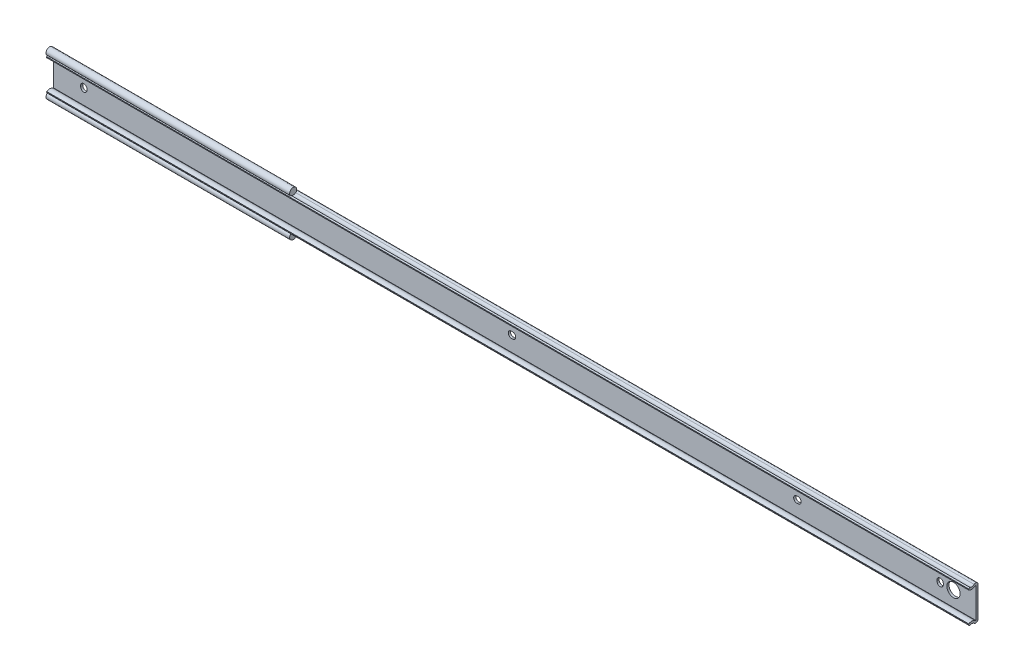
ISO-10303-21;
HEADER;
FILE_DESCRIPTION(('STEP AP214'),'2;1');
FILE_NAME('part.step','',(''),(''),'','','');
FILE_SCHEMA(('AUTOMOTIVE_DESIGN { 1 0 10303 214 1 1 1 1 }'));
ENDSEC;
DATA;
#1=APPLICATION_CONTEXT('core data for automotive mechanical design processes');
#2=APPLICATION_PROTOCOL_DEFINITION('international standard','automotive_design',2000,#1);
#3=PRODUCT_CONTEXT('',#1,'mechanical');
#4=PRODUCT('Part','Part','',(#3));
#5=PRODUCT_RELATED_PRODUCT_CATEGORY('part','',(#4));
#6=PRODUCT_DEFINITION_FORMATION('','',#4);
#7=PRODUCT_DEFINITION_CONTEXT('part definition',#1,'design');
#8=PRODUCT_DEFINITION('design','',#6,#7);
#9=PRODUCT_DEFINITION_SHAPE('','',#8);
#10=(LENGTH_UNIT() NAMED_UNIT(*) SI_UNIT(.MILLI.,.METRE.));
#11=(NAMED_UNIT(*) PLANE_ANGLE_UNIT() SI_UNIT($,.RADIAN.));
#12=(NAMED_UNIT(*) SI_UNIT($,.STERADIAN.) SOLID_ANGLE_UNIT());
#13=UNCERTAINTY_MEASURE_WITH_UNIT(LENGTH_MEASURE(1.E-05),#10,'distance_accuracy_value','');
#14=(GEOMETRIC_REPRESENTATION_CONTEXT(3) GLOBAL_UNCERTAINTY_ASSIGNED_CONTEXT((#13)) GLOBAL_UNIT_ASSIGNED_CONTEXT((#10,
#11,#12)) REPRESENTATION_CONTEXT('',''));
#15=CARTESIAN_POINT('',(0.,0.,0.));
#16=DIRECTION('',(0.,0.,1.));
#17=DIRECTION('',(1.,0.,0.));
#18=AXIS2_PLACEMENT_3D('',#15,#16,#17);
#19=CARTESIAN_POINT('',(-21.4,13.9150000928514,4.44999970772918));
#20=DIRECTION('',(1.,0.,0.));
#21=DIRECTION('',(0.,0.,-1.));
#22=AXIS2_PLACEMENT_3D('',#19,#20,#21);
#23=CYLINDRICAL_SURFACE('',#22,2.55000008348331);
#24=DIRECTION('',(1.,0.,0.));
#25=VECTOR('',#24,1.);
#26=CARTESIAN_POINT('',(-21.4,12.0053612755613,2.76009438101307));
#27=LINE('',#26,#25);
#28=CARTESIAN_POINT('',(152.,12.0053612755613,2.76009438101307));
#29=VERTEX_POINT('',#28);
#30=CARTESIAN_POINT('',(635.,12.0053612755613,2.76009438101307));
#31=VERTEX_POINT('',#30);
#32=EDGE_CURVE('E406',#29,#31,#27,.T.);
#33=ORIENTED_EDGE('',*,*,#32,.F.);
#34=CARTESIAN_POINT('',(152.,13.9150000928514,4.44999970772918));
#35=DIRECTION('',(-1.,0.,0.));
#36=DIRECTION('',(0.,0.,1.));
#37=AXIS2_PLACEMENT_3D('',#34,#35,#36);
#38=CIRCLE('',#37,2.55000008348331);
#39=CARTESIAN_POINT('',(152.,11.8784794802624,5.98462807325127));
#40=VERTEX_POINT('',#39);
#41=EDGE_CURVE('E468',#29,#40,#38,.T.);
#42=ORIENTED_EDGE('',*,*,#41,.T.);
#43=DIRECTION('',(1.,0.,0.));
#44=VECTOR('',#43,1.);
#45=CARTESIAN_POINT('',(-21.4,11.8784794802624,5.98462807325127));
#46=LINE('',#45,#44);
#47=CARTESIAN_POINT('',(635.,11.8784794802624,5.98462807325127));
#48=VERTEX_POINT('',#47);
#49=EDGE_CURVE('E432',#40,#48,#46,.T.);
#50=ORIENTED_EDGE('',*,*,#49,.T.);
#51=CARTESIAN_POINT('',(635.,13.9150000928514,4.44999970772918));
#52=DIRECTION('',(-1.,0.,0.));
#53=DIRECTION('',(0.,0.,-1.));
#54=AXIS2_PLACEMENT_3D('',#51,#52,#53);
#55=CIRCLE('',#54,2.55000008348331);
#56=EDGE_CURVE('E336',#31,#48,#55,.T.);
#57=ORIENTED_EDGE('',*,*,#56,.F.);
#58=EDGE_LOOP('',(#33,#42,#50,#57));
#59=FACE_BOUND('',#58,.T.);
#60=ADVANCED_FACE('F14',(#59),#23,.F.);
#61=CARTESIAN_POINT('',(-21.4,10.762224,1.65999962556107));
#62=DIRECTION('',(1.,0.,0.));
#63=DIRECTION('',(0.,0.,-1.));
#64=AXIS2_PLACEMENT_3D('',#61,#62,#63);
#65=CYLINDRICAL_SURFACE('',#64,1.65999962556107);
#66=DIRECTION('',(-1.,0.,0.));
#67=VECTOR('',#66,1.);
#68=CARTESIAN_POINT('',(65.3,12.2965303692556,2.29364205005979));
#69=LINE('',#68,#67);
#70=CARTESIAN_POINT('',(152.,12.2965303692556,2.29364205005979));
#71=VERTEX_POINT('',#70);
#72=CARTESIAN_POINT('',(-21.4,12.2965303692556,2.29364205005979));
#73=VERTEX_POINT('',#72);
#74=EDGE_CURVE('E275',#71,#73,#69,.T.);
#75=ORIENTED_EDGE('',*,*,#74,.F.);
#76=CARTESIAN_POINT('',(152.,10.762224,1.65999962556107));
#77=DIRECTION('',(-1.,0.,0.));
#78=DIRECTION('',(0.,0.,1.));
#79=AXIS2_PLACEMENT_3D('',#76,#77,#78);
#80=CIRCLE('',#79,1.65999962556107);
#81=EDGE_CURVE('E489',#71,#29,#80,.F.);
#82=ORIENTED_EDGE('',*,*,#81,.T.);
#83=ORIENTED_EDGE('',*,*,#32,.T.);
#84=CARTESIAN_POINT('',(635.,10.762224,1.65999962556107));
#85=DIRECTION('',(1.,0.,0.));
#86=DIRECTION('',(0.,0.,-1.));
#87=AXIS2_PLACEMENT_3D('',#84,#85,#86);
#88=CIRCLE('',#87,1.65999962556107);
#89=CARTESIAN_POINT('',(635.,10.762224,0.));
#90=VERTEX_POINT('',#89);
#91=EDGE_CURVE('E333',#90,#31,#88,.T.);
#92=ORIENTED_EDGE('',*,*,#91,.F.);
#93=DIRECTION('',(1.,0.,0.));
#94=VECTOR('',#93,1.);
#95=CARTESIAN_POINT('',(-21.4,10.762224,0.));
#96=LINE('',#95,#94);
#97=CARTESIAN_POINT('',(-21.4,10.762224,0.));
#98=VERTEX_POINT('',#97);
#99=EDGE_CURVE('E407',#98,#90,#96,.T.);
#100=ORIENTED_EDGE('',*,*,#99,.F.);
#101=CARTESIAN_POINT('',(-21.4,10.762224,1.65999962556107));
#102=DIRECTION('',(1.,0.,0.));
#103=DIRECTION('',(0.,0.,-1.));
#104=AXIS2_PLACEMENT_3D('',#101,#102,#103);
#105=CIRCLE('',#104,1.65999962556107);
#106=EDGE_CURVE('E376',#98,#73,#105,.T.);
#107=ORIENTED_EDGE('',*,*,#106,.T.);
#108=EDGE_LOOP('',(#75,#82,#83,#92,#100,#107));
#109=FACE_BOUND('',#108,.T.);
#110=ADVANCED_FACE('F16',(#109),#65,.T.);
#111=CARTESIAN_POINT('',(-21.4,-10.762224,0.));
#112=DIRECTION('',(0.,0.,-1.));
#113=DIRECTION('',(-1.,0.,0.));
#114=AXIS2_PLACEMENT_3D('',#111,#112,#113);
#115=PLANE('',#114);
#116=CARTESIAN_POINT('',(619.1,0.,0.));
#117=DIRECTION('',(0.,0.,-1.));
#118=DIRECTION('',(-1.,0.,0.));
#119=AXIS2_PLACEMENT_3D('',#116,#117,#118);
#120=CIRCLE('',#119,4.75);
#121=CARTESIAN_POINT('',(614.35,0.,0.));
#122=VERTEX_POINT('',#121);
#123=EDGE_CURVE('E308',#122,#122,#120,.T.);
#124=ORIENTED_EDGE('',*,*,#123,.F.);
#125=EDGE_LOOP('',(#124));
#126=FACE_BOUND('',#125,.T.);
#127=CARTESIAN_POINT('',(508.4,0.,0.));
#128=DIRECTION('',(0.,0.,-1.));
#129=DIRECTION('',(-1.,0.,0.));
#130=AXIS2_PLACEMENT_3D('',#127,#128,#129);
#131=CIRCLE('',#130,2.25);
#132=CARTESIAN_POINT('',(508.4,2.25,0.));
#133=VERTEX_POINT('',#132);
#134=CARTESIAN_POINT('',(508.4,-2.25,0.));
#135=VERTEX_POINT('',#134);
#136=EDGE_CURVE('E272',#133,#135,#131,.T.);
#137=ORIENTED_EDGE('',*,*,#136,.F.);
#138=DIRECTION('',(1.,0.,0.));
#139=VECTOR('',#138,1.);
#140=CARTESIAN_POINT('',(508.4,2.25,0.));
#141=LINE('',#140,#139);
#142=CARTESIAN_POINT('',(507.6,2.25,0.));
#143=VERTEX_POINT('',#142);
#144=EDGE_CURVE('E281',#143,#133,#141,.T.);
#145=ORIENTED_EDGE('',*,*,#144,.F.);
#146=CARTESIAN_POINT('',(507.6,0.,0.));
#147=DIRECTION('',(0.,0.,-1.));
#148=DIRECTION('',(-1.,0.,0.));
#149=AXIS2_PLACEMENT_3D('',#146,#147,#148);
#150=CIRCLE('',#149,2.25);
#151=CARTESIAN_POINT('',(507.6,-2.25,0.));
#152=VERTEX_POINT('',#151);
#153=EDGE_CURVE('E278',#152,#143,#150,.T.);
#154=ORIENTED_EDGE('',*,*,#153,.F.);
#155=DIRECTION('',(-1.,0.,0.));
#156=VECTOR('',#155,1.);
#157=CARTESIAN_POINT('',(508.4,-2.25,0.));
#158=LINE('',#157,#156);
#159=EDGE_CURVE('E274',#135,#152,#158,.T.);
#160=ORIENTED_EDGE('',*,*,#159,.F.);
#161=EDGE_LOOP('',(#137,#145,#154,#160));
#162=FACE_BOUND('',#161,.T.);
#163=CARTESIAN_POINT('',(0.,0.4,0.));
#164=DIRECTION('',(0.,0.,-1.));
#165=DIRECTION('',(-1.,0.,0.));
#166=AXIS2_PLACEMENT_3D('',#163,#164,#165);
#167=CIRCLE('',#166,2.24999999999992);
#168=CARTESIAN_POINT('',(-2.24999999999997,0.4,0.));
#169=VERTEX_POINT('',#168);
#170=CARTESIAN_POINT('',(2.24999999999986,0.4,0.));
#171=VERTEX_POINT('',#170);
#172=EDGE_CURVE('E257',#169,#171,#167,.T.);
#173=ORIENTED_EDGE('',*,*,#172,.F.);
#174=DIRECTION('',(0.,1.,0.));
#175=VECTOR('',#174,1.);
#176=CARTESIAN_POINT('',(-2.24999999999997,0.4,0.));
#177=LINE('',#176,#175);
#178=CARTESIAN_POINT('',(-2.24999999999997,-0.4,0.));
#179=VERTEX_POINT('',#178);
#180=EDGE_CURVE('E262',#179,#169,#177,.T.);
#181=ORIENTED_EDGE('',*,*,#180,.F.);
#182=CARTESIAN_POINT('',(0.,-0.4,0.));
#183=DIRECTION('',(0.,0.,-1.));
#184=DIRECTION('',(-1.,0.,0.));
#185=AXIS2_PLACEMENT_3D('',#182,#183,#184);
#186=CIRCLE('',#185,2.24999999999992);
#187=CARTESIAN_POINT('',(2.24999999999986,-0.4,0.));
#188=VERTEX_POINT('',#187);
#189=EDGE_CURVE('E241',#188,#179,#186,.T.);
#190=ORIENTED_EDGE('',*,*,#189,.F.);
#191=DIRECTION('',(0.,-1.,0.));
#192=VECTOR('',#191,1.);
#193=CARTESIAN_POINT('',(2.24999999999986,0.4,0.));
#194=LINE('',#193,#192);
#195=EDGE_CURVE('E252',#171,#188,#194,.T.);
#196=ORIENTED_EDGE('',*,*,#195,.F.);
#197=EDGE_LOOP('',(#173,#181,#190,#196));
#198=FACE_BOUND('',#197,.T.);
#199=CARTESIAN_POINT('',(305.2,0.,0.));
#200=DIRECTION('',(0.,0.,-1.));
#201=DIRECTION('',(-1.,0.,0.));
#202=AXIS2_PLACEMENT_3D('',#199,#200,#201);
#203=CIRCLE('',#202,2.25);
#204=CARTESIAN_POINT('',(305.2,2.25,0.));
#205=VERTEX_POINT('',#204);
#206=CARTESIAN_POINT('',(305.2,-2.25,0.));
#207=VERTEX_POINT('',#206);
#208=EDGE_CURVE('E269',#205,#207,#203,.T.);
#209=ORIENTED_EDGE('',*,*,#208,.F.);
#210=DIRECTION('',(1.,0.,0.));
#211=VECTOR('',#210,1.);
#212=CARTESIAN_POINT('',(305.2,2.25,0.));
#213=LINE('',#212,#211);
#214=CARTESIAN_POINT('',(304.4,2.25,0.));
#215=VERTEX_POINT('',#214);
#216=EDGE_CURVE('E322',#215,#205,#213,.T.);
#217=ORIENTED_EDGE('',*,*,#216,.F.);
#218=CARTESIAN_POINT('',(304.4,0.,0.));
#219=DIRECTION('',(0.,0.,-1.));
#220=DIRECTION('',(-1.,0.,0.));
#221=AXIS2_PLACEMENT_3D('',#218,#219,#220);
#222=CIRCLE('',#221,2.25);
#223=CARTESIAN_POINT('',(304.4,-2.25,0.));
#224=VERTEX_POINT('',#223);
#225=EDGE_CURVE('E319',#224,#215,#222,.T.);
#226=ORIENTED_EDGE('',*,*,#225,.F.);
#227=DIRECTION('',(-1.,0.,0.));
#228=VECTOR('',#227,1.);
#229=CARTESIAN_POINT('',(305.2,-2.25,0.));
#230=LINE('',#229,#228);
#231=EDGE_CURVE('E316',#207,#224,#230,.T.);
#232=ORIENTED_EDGE('',*,*,#231,.F.);
#233=EDGE_LOOP('',(#209,#217,#226,#232));
#234=FACE_BOUND('',#233,.T.);
#235=CARTESIAN_POINT('',(609.6,0.4,0.));
#236=DIRECTION('',(0.,0.,-1.));
#237=DIRECTION('',(-1.,0.,0.));
#238=AXIS2_PLACEMENT_3D('',#235,#236,#237);
#239=CIRCLE('',#238,2.25);
#240=CARTESIAN_POINT('',(607.35,0.4,0.));
#241=VERTEX_POINT('',#240);
#242=CARTESIAN_POINT('',(611.85,0.4,0.));
#243=VERTEX_POINT('',#242);
#244=EDGE_CURVE('E293',#241,#243,#239,.T.);
#245=ORIENTED_EDGE('',*,*,#244,.F.);
#246=DIRECTION('',(0.,1.,0.));
#247=VECTOR('',#246,1.);
#248=CARTESIAN_POINT('',(607.35,0.4,0.));
#249=LINE('',#248,#247);
#250=CARTESIAN_POINT('',(607.35,-0.4,0.));
#251=VERTEX_POINT('',#250);
#252=EDGE_CURVE('E302',#251,#241,#249,.T.);
#253=ORIENTED_EDGE('',*,*,#252,.F.);
#254=CARTESIAN_POINT('',(609.6,-0.4,0.));
#255=DIRECTION('',(0.,0.,-1.));
#256=DIRECTION('',(-1.,0.,0.));
#257=AXIS2_PLACEMENT_3D('',#254,#255,#256);
#258=CIRCLE('',#257,2.25);
#259=CARTESIAN_POINT('',(611.85,-0.4,0.));
#260=VERTEX_POINT('',#259);
#261=EDGE_CURVE('E299',#260,#251,#258,.T.);
#262=ORIENTED_EDGE('',*,*,#261,.F.);
#263=DIRECTION('',(0.,-1.,0.));
#264=VECTOR('',#263,1.);
#265=CARTESIAN_POINT('',(611.85,0.4,0.));
#266=LINE('',#265,#264);
#267=EDGE_CURVE('E295',#243,#260,#266,.T.);
#268=ORIENTED_EDGE('',*,*,#267,.F.);
#269=EDGE_LOOP('',(#245,#253,#262,#268));
#270=FACE_BOUND('',#269,.T.);
#271=DIRECTION('',(0.,1.,0.));
#272=VECTOR('',#271,1.);
#273=CARTESIAN_POINT('',(-21.4,-10.762224,0.));
#274=LINE('',#273,#272);
#275=CARTESIAN_POINT('',(-21.4,-10.762224,0.));
#276=VERTEX_POINT('',#275);
#277=EDGE_CURVE('E404',#276,#98,#274,.T.);
#278=ORIENTED_EDGE('',*,*,#277,.T.);
#279=ORIENTED_EDGE('',*,*,#99,.T.);
#280=DIRECTION('',(0.,1.,0.));
#281=VECTOR('',#280,1.);
#282=CARTESIAN_POINT('',(635.,-10.762224,0.));
#283=LINE('',#282,#281);
#284=CARTESIAN_POINT('',(635.,-10.762224,0.));
#285=VERTEX_POINT('',#284);
#286=EDGE_CURVE('E373',#285,#90,#283,.T.);
#287=ORIENTED_EDGE('',*,*,#286,.F.);
#288=DIRECTION('',(1.,0.,0.));
#289=VECTOR('',#288,1.);
#290=CARTESIAN_POINT('',(-21.4,-10.762224,0.));
#291=LINE('',#290,#289);
#292=EDGE_CURVE('E410',#276,#285,#291,.T.);
#293=ORIENTED_EDGE('',*,*,#292,.F.);
#294=EDGE_LOOP('',(#278,#279,#287,#293));
#295=FACE_BOUND('',#294,.T.);
#296=ADVANCED_FACE('F259',(#126,#162,#198,#234,#270,#295),#115,.T.);
#297=CARTESIAN_POINT('',(-21.4,-10.762224,1.65999962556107));
#298=DIRECTION('',(1.,0.,0.));
#299=DIRECTION('',(0.,0.,-1.));
#300=AXIS2_PLACEMENT_3D('',#297,#298,#299);
#301=CYLINDRICAL_SURFACE('',#300,1.65999962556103);
#302=DIRECTION('',(-1.,0.,0.));
#303=VECTOR('',#302,1.);
#304=CARTESIAN_POINT('',(65.3,-12.2965303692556,2.29364205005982));
#305=LINE('',#304,#303);
#306=CARTESIAN_POINT('',(-21.4,-12.2965303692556,2.29364205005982));
#307=VERTEX_POINT('',#306);
#308=CARTESIAN_POINT('',(152.,-12.2965303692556,2.29364205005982));
#309=VERTEX_POINT('',#308);
#310=EDGE_CURVE('E579',#307,#309,#305,.F.);
#311=ORIENTED_EDGE('',*,*,#310,.F.);
#312=CARTESIAN_POINT('',(-21.4,-10.762224,1.65999962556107));
#313=DIRECTION('',(1.,0.,0.));
#314=DIRECTION('',(0.,0.,1.));
#315=AXIS2_PLACEMENT_3D('',#312,#313,#314);
#316=CIRCLE('',#315,1.65999962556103);
#317=EDGE_CURVE('E402',#307,#276,#316,.T.);
#318=ORIENTED_EDGE('',*,*,#317,.T.);
#319=ORIENTED_EDGE('',*,*,#292,.T.);
#320=CARTESIAN_POINT('',(635.,-10.762224,1.65999962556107));
#321=DIRECTION('',(1.,0.,0.));
#322=DIRECTION('',(0.,0.,1.));
#323=AXIS2_PLACEMENT_3D('',#320,#321,#322);
#324=CIRCLE('',#323,1.65999962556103);
#325=CARTESIAN_POINT('',(635.,-12.0036867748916,2.76198371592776));
#326=VERTEX_POINT('',#325);
#327=EDGE_CURVE('E370',#326,#285,#324,.T.);
#328=ORIENTED_EDGE('',*,*,#327,.F.);
#329=DIRECTION('',(1.,0.,0.));
#330=VECTOR('',#329,1.);
#331=CARTESIAN_POINT('',(-21.4,-12.0036867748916,2.76198371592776));
#332=LINE('',#331,#330);
#333=CARTESIAN_POINT('',(152.,-12.0036867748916,2.76198371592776));
#334=VERTEX_POINT('',#333);
#335=EDGE_CURVE('E412',#334,#326,#332,.T.);
#336=ORIENTED_EDGE('',*,*,#335,.F.);
#337=CARTESIAN_POINT('',(152.,-10.762224,1.65999962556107));
#338=DIRECTION('',(1.,0.,0.));
#339=DIRECTION('',(0.,0.,-1.));
#340=AXIS2_PLACEMENT_3D('',#337,#338,#339);
#341=CIRCLE('',#340,1.65999962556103);
#342=EDGE_CURVE('E29',#309,#334,#341,.F.);
#343=ORIENTED_EDGE('',*,*,#342,.F.);
#344=EDGE_LOOP('',(#311,#318,#319,#328,#336,#343));
#345=FACE_BOUND('',#344,.T.);
#346=ADVANCED_FACE('F570',(#345),#301,.T.);
#347=CARTESIAN_POINT('',(-21.4,-13.9149976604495,4.44999754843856));
#348=DIRECTION('',(1.,0.,0.));
#349=DIRECTION('',(0.,0.,-1.));
#350=AXIS2_PLACEMENT_3D('',#347,#348,#349);
#351=CYLINDRICAL_SURFACE('',#350,2.55000000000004);
#352=CARTESIAN_POINT('',(152.,-13.9149976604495,4.44999754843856));
#353=DIRECTION('',(1.,0.,0.));
#354=DIRECTION('',(0.,0.,-1.));
#355=AXIS2_PLACEMENT_3D('',#352,#353,#354);
#356=CIRCLE('',#355,2.55000000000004);
#357=CARTESIAN_POINT('',(152.,-11.8784773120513,5.98462612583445));
#358=VERTEX_POINT('',#357);
#359=EDGE_CURVE('E37',#334,#358,#356,.T.);
#360=ORIENTED_EDGE('',*,*,#359,.F.);
#361=ORIENTED_EDGE('',*,*,#335,.T.);
#362=CARTESIAN_POINT('',(635.,-13.9149976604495,4.44999754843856));
#363=DIRECTION('',(-1.,0.,0.));
#364=DIRECTION('',(0.,0.,1.));
#365=AXIS2_PLACEMENT_3D('',#362,#363,#364);
#366=CIRCLE('',#365,2.55000000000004);
#367=CARTESIAN_POINT('',(635.,-11.8784773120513,5.98462612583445));
#368=VERTEX_POINT('',#367);
#369=EDGE_CURVE('E367',#368,#326,#366,.T.);
#370=ORIENTED_EDGE('',*,*,#369,.F.);
#371=DIRECTION('',(1.,0.,0.));
#372=VECTOR('',#371,1.);
#373=CARTESIAN_POINT('',(-21.4,-11.8784773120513,5.98462612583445));
#374=LINE('',#373,#372);
#375=EDGE_CURVE('E414',#358,#368,#374,.T.);
#376=ORIENTED_EDGE('',*,*,#375,.F.);
#377=EDGE_LOOP('',(#360,#361,#370,#376));
#378=FACE_BOUND('',#377,.T.);
#379=ADVANCED_FACE('F573',(#378),#351,.F.);
#380=CARTESIAN_POINT('',(-21.4,-11.8784773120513,5.98462612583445));
#381=DIRECTION('',(0.,-0.601815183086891,0.798635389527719));
#382=DIRECTION('',(0.,-0.798635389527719,-0.601815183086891));
#383=AXIS2_PLACEMENT_3D('',#380,#381,#382);
#384=PLANE('',#383);
#385=DIRECTION('',(-1.,0.,0.));
#386=VECTOR('',#385,1.);
#387=CARTESIAN_POINT('',(152.,-11.641839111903,6.16294587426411));
#388=LINE('',#387,#386);
#389=CARTESIAN_POINT('',(152.,-11.641839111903,6.16294587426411));
#390=VERTEX_POINT('',#389);
#391=CARTESIAN_POINT('',(-21.4,-11.641839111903,6.16294587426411));
#392=VERTEX_POINT('',#391);
#393=EDGE_CURVE('E580',#390,#392,#388,.T.);
#394=ORIENTED_EDGE('',*,*,#393,.F.);
#395=DIRECTION('',(0.,0.798635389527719,0.601815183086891));
#396=VECTOR('',#395,1.);
#397=CARTESIAN_POINT('',(152.,-11.8784773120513,5.98462612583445));
#398=LINE('',#397,#396);
#399=EDGE_CURVE('E9',#358,#390,#398,.T.);
#400=ORIENTED_EDGE('',*,*,#399,.F.);
#401=ORIENTED_EDGE('',*,*,#375,.T.);
#402=DIRECTION('',(0.,-0.798635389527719,-0.601815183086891));
#403=VECTOR('',#402,1.);
#404=CARTESIAN_POINT('',(635.,-11.8784773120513,5.98462612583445));
#405=LINE('',#404,#403);
#406=CARTESIAN_POINT('',(635.,-11.0618545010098,6.59999580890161));
#407=VERTEX_POINT('',#406);
#408=EDGE_CURVE('E364',#407,#368,#405,.T.);
#409=ORIENTED_EDGE('',*,*,#408,.F.);
#410=DIRECTION('',(1.,0.,0.));
#411=VECTOR('',#410,1.);
#412=CARTESIAN_POINT('',(-21.4,-11.0618545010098,6.59999580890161));
#413=LINE('',#412,#411);
#414=CARTESIAN_POINT('',(-21.4,-11.0618545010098,6.59999580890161));
#415=VERTEX_POINT('',#414);
#416=EDGE_CURVE('E416',#415,#407,#413,.T.);
#417=ORIENTED_EDGE('',*,*,#416,.F.);
#418=DIRECTION('',(0.,-0.798635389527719,-0.601815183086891));
#419=VECTOR('',#418,1.);
#420=CARTESIAN_POINT('',(-21.4,-11.8784773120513,5.98462612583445));
#421=LINE('',#420,#419);
#422=EDGE_CURVE('E400',#415,#392,#421,.T.);
#423=ORIENTED_EDGE('',*,*,#422,.T.);
#424=EDGE_LOOP('',(#394,#400,#401,#409,#417,#423));
#425=FACE_BOUND('',#424,.T.);
#426=ADVANCED_FACE('F511',(#425),#384,.T.);
#427=CARTESIAN_POINT('',(-21.4,-10.7845049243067,1.54999983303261));
#428=DIRECTION('',(0.,0.,1.));
#429=DIRECTION('',(0.,-1.,0.));
#430=AXIS2_PLACEMENT_3D('',#427,#428,#429);
#431=PLANE('',#430);
#432=CARTESIAN_POINT('',(619.1,0.,1.54999983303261));
#433=DIRECTION('',(0.,0.,1.));
#434=DIRECTION('',(0.,-1.,0.));
#435=AXIS2_PLACEMENT_3D('',#432,#433,#434);
#436=CIRCLE('',#435,4.75);
#437=CARTESIAN_POINT('',(619.1,-4.75,1.54999983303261));
#438=VERTEX_POINT('',#437);
#439=EDGE_CURVE('E337',#438,#438,#436,.T.);
#440=ORIENTED_EDGE('',*,*,#439,.F.);
#441=EDGE_LOOP('',(#440));
#442=FACE_BOUND('',#441,.T.);
#443=CARTESIAN_POINT('',(508.4,0.,1.54999983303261));
#444=DIRECTION('',(0.,0.,1.));
#445=DIRECTION('',(0.,-1.,0.));
#446=AXIS2_PLACEMENT_3D('',#443,#444,#445);
#447=CIRCLE('',#446,2.25);
#448=CARTESIAN_POINT('',(508.4,-2.25,1.54999983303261));
#449=VERTEX_POINT('',#448);
#450=CARTESIAN_POINT('',(508.4,2.25,1.54999983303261));
#451=VERTEX_POINT('',#450);
#452=EDGE_CURVE('E466',#449,#451,#447,.T.);
#453=ORIENTED_EDGE('',*,*,#452,.F.);
#454=DIRECTION('',(1.,0.,0.));
#455=VECTOR('',#454,1.);
#456=CARTESIAN_POINT('',(-21.4,-2.24999999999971,1.54999983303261));
#457=LINE('',#456,#455);
#458=CARTESIAN_POINT('',(507.6,-2.25,1.54999983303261));
#459=VERTEX_POINT('',#458);
#460=EDGE_CURVE('E459',#459,#449,#457,.T.);
#461=ORIENTED_EDGE('',*,*,#460,.F.);
#462=CARTESIAN_POINT('',(507.6,0.,1.54999983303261));
#463=DIRECTION('',(0.,0.,1.));
#464=DIRECTION('',(0.,-1.,0.));
#465=AXIS2_PLACEMENT_3D('',#462,#463,#464);
#466=CIRCLE('',#465,2.25);
#467=CARTESIAN_POINT('',(507.6,2.25,1.54999983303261));
#468=VERTEX_POINT('',#467);
#469=EDGE_CURVE('E461',#468,#459,#466,.T.);
#470=ORIENTED_EDGE('',*,*,#469,.F.);
#471=DIRECTION('',(-1.,0.,0.));
#472=VECTOR('',#471,1.);
#473=CARTESIAN_POINT('',(-21.4,2.25000000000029,1.54999983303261));
#474=LINE('',#473,#472);
#475=EDGE_CURVE('E464',#451,#468,#474,.T.);
#476=ORIENTED_EDGE('',*,*,#475,.F.);
#477=EDGE_LOOP('',(#453,#461,#470,#476));
#478=FACE_BOUND('',#477,.T.);
#479=CARTESIAN_POINT('',(0.,0.4,1.54999983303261));
#480=DIRECTION('',(0.,0.,1.));
#481=DIRECTION('',(0.,-1.,0.));
#482=AXIS2_PLACEMENT_3D('',#479,#480,#481);
#483=CIRCLE('',#482,2.24999999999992);
#484=CARTESIAN_POINT('',(2.24999999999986,0.4,1.54999983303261));
#485=VERTEX_POINT('',#484);
#486=CARTESIAN_POINT('',(-2.24999999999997,0.4,1.54999983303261));
#487=VERTEX_POINT('',#486);
#488=EDGE_CURVE('E457',#485,#487,#483,.T.);
#489=ORIENTED_EDGE('',*,*,#488,.F.);
#490=DIRECTION('',(0.,1.,0.));
#491=VECTOR('',#490,1.);
#492=CARTESIAN_POINT('',(2.24999999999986,-10.7845049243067,1.54999983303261));
#493=LINE('',#492,#491);
#494=CARTESIAN_POINT('',(2.24999999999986,-0.4,1.54999983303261));
#495=VERTEX_POINT('',#494);
#496=EDGE_CURVE('E452',#495,#485,#493,.T.);
#497=ORIENTED_EDGE('',*,*,#496,.F.);
#498=CARTESIAN_POINT('',(0.,-0.4,1.54999983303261));
#499=DIRECTION('',(0.,0.,1.));
#500=DIRECTION('',(0.,-1.,0.));
#501=AXIS2_PLACEMENT_3D('',#498,#499,#500);
#502=CIRCLE('',#501,2.24999999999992);
#503=CARTESIAN_POINT('',(-2.24999999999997,-0.4,1.54999983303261));
#504=VERTEX_POINT('',#503);
#505=EDGE_CURVE('E244',#504,#495,#502,.T.);
#506=ORIENTED_EDGE('',*,*,#505,.F.);
#507=DIRECTION('',(0.,-1.,0.));
#508=VECTOR('',#507,1.);
#509=CARTESIAN_POINT('',(-2.24999999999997,-10.7845049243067,1.54999983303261));
#510=LINE('',#509,#508);
#511=EDGE_CURVE('E455',#487,#504,#510,.T.);
#512=ORIENTED_EDGE('',*,*,#511,.F.);
#513=EDGE_LOOP('',(#489,#497,#506,#512));
#514=FACE_BOUND('',#513,.T.);
#515=CARTESIAN_POINT('',(305.2,0.,1.54999983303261));
#516=DIRECTION('',(0.,0.,1.));
#517=DIRECTION('',(0.,-1.,0.));
#518=AXIS2_PLACEMENT_3D('',#515,#516,#517);
#519=CIRCLE('',#518,2.25);
#520=CARTESIAN_POINT('',(305.2,-2.25,1.54999983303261));
#521=VERTEX_POINT('',#520);
#522=CARTESIAN_POINT('',(305.2,2.25,1.54999983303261));
#523=VERTEX_POINT('',#522);
#524=EDGE_CURVE('E450',#521,#523,#519,.T.);
#525=ORIENTED_EDGE('',*,*,#524,.F.);
#526=DIRECTION('',(1.,0.,0.));
#527=VECTOR('',#526,1.);
#528=CARTESIAN_POINT('',(-21.4,-2.25,1.54999983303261));
#529=LINE('',#528,#527);
#530=CARTESIAN_POINT('',(304.4,-2.25,1.54999983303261));
#531=VERTEX_POINT('',#530);
#532=EDGE_CURVE('E443',#531,#521,#529,.T.);
#533=ORIENTED_EDGE('',*,*,#532,.F.);
#534=CARTESIAN_POINT('',(304.4,0.,1.54999983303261));
#535=DIRECTION('',(0.,0.,1.));
#536=DIRECTION('',(0.,-1.,0.));
#537=AXIS2_PLACEMENT_3D('',#534,#535,#536);
#538=CIRCLE('',#537,2.25);
#539=CARTESIAN_POINT('',(304.4,2.25,1.54999983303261));
#540=VERTEX_POINT('',#539);
#541=EDGE_CURVE('E445',#540,#531,#538,.T.);
#542=ORIENTED_EDGE('',*,*,#541,.F.);
#543=DIRECTION('',(-1.,0.,0.));
#544=VECTOR('',#543,1.);
#545=CARTESIAN_POINT('',(-21.4,2.25,1.54999983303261));
#546=LINE('',#545,#544);
#547=EDGE_CURVE('E448',#523,#540,#546,.T.);
#548=ORIENTED_EDGE('',*,*,#547,.F.);
#549=EDGE_LOOP('',(#525,#533,#542,#548));
#550=FACE_BOUND('',#549,.T.);
#551=CARTESIAN_POINT('',(609.6,0.4,1.54999983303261));
#552=DIRECTION('',(0.,0.,1.));
#553=DIRECTION('',(0.,-1.,0.));
#554=AXIS2_PLACEMENT_3D('',#551,#552,#553);
#555=CIRCLE('',#554,2.25);
#556=CARTESIAN_POINT('',(611.85,0.4,1.54999983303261));
#557=VERTEX_POINT('',#556);
#558=CARTESIAN_POINT('',(607.35,0.4,1.54999983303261));
#559=VERTEX_POINT('',#558);
#560=EDGE_CURVE('E441',#557,#559,#555,.T.);
#561=ORIENTED_EDGE('',*,*,#560,.F.);
#562=DIRECTION('',(0.,1.,0.));
#563=VECTOR('',#562,1.);
#564=CARTESIAN_POINT('',(611.85,-10.7845049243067,1.54999983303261));
#565=LINE('',#564,#563);
#566=CARTESIAN_POINT('',(611.85,-0.4,1.54999983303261));
#567=VERTEX_POINT('',#566);
#568=EDGE_CURVE('E409',#567,#557,#565,.T.);
#569=ORIENTED_EDGE('',*,*,#568,.F.);
#570=CARTESIAN_POINT('',(609.6,-0.4,1.54999983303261));
#571=DIRECTION('',(0.,0.,1.));
#572=DIRECTION('',(0.,-1.,0.));
#573=AXIS2_PLACEMENT_3D('',#570,#571,#572);
#574=CIRCLE('',#573,2.25);
#575=CARTESIAN_POINT('',(607.35,-0.4,1.54999983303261));
#576=VERTEX_POINT('',#575);
#577=EDGE_CURVE('E436',#576,#567,#574,.T.);
#578=ORIENTED_EDGE('',*,*,#577,.F.);
#579=DIRECTION('',(0.,-1.,0.));
#580=VECTOR('',#579,1.);
#581=CARTESIAN_POINT('',(607.35,-10.7845049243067,1.54999983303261));
#582=LINE('',#581,#580);
#583=EDGE_CURVE('E439',#559,#576,#582,.T.);
#584=ORIENTED_EDGE('',*,*,#583,.F.);
#585=EDGE_LOOP('',(#561,#569,#578,#584));
#586=FACE_BOUND('',#585,.T.);
#587=DIRECTION('',(0.,-1.,0.));
#588=VECTOR('',#587,1.);
#589=CARTESIAN_POINT('',(-21.4,-10.7845049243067,1.54999983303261));
#590=LINE('',#589,#588);
#591=CARTESIAN_POINT('',(-21.4,10.7845049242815,1.54999983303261));
#592=VERTEX_POINT('',#591);
#593=CARTESIAN_POINT('',(-21.4,-10.7845049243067,1.54999983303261));
#594=VERTEX_POINT('',#593);
#595=EDGE_CURVE('E389',#592,#594,#590,.T.);
#596=ORIENTED_EDGE('',*,*,#595,.T.);
#597=DIRECTION('',(1.,0.,0.));
#598=VECTOR('',#597,1.);
#599=CARTESIAN_POINT('',(-21.4,-10.7845049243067,1.54999983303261));
#600=LINE('',#599,#598);
#601=CARTESIAN_POINT('',(635.,-10.7845049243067,1.54999983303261));
#602=VERTEX_POINT('',#601);
#603=EDGE_CURVE('E422',#594,#602,#600,.T.);
#604=ORIENTED_EDGE('',*,*,#603,.T.);
#605=DIRECTION('',(0.,-1.,0.));
#606=VECTOR('',#605,1.);
#607=CARTESIAN_POINT('',(635.,-10.7845049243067,1.54999983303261));
#608=LINE('',#607,#606);
#609=CARTESIAN_POINT('',(635.,10.7845049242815,1.54999983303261));
#610=VERTEX_POINT('',#609);
#611=EDGE_CURVE('E352',#610,#602,#608,.T.);
#612=ORIENTED_EDGE('',*,*,#611,.F.);
#613=DIRECTION('',(1.,0.,0.));
#614=VECTOR('',#613,1.);
#615=CARTESIAN_POINT('',(-21.4,10.7845049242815,1.54999983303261));
#616=LINE('',#615,#614);
#617=EDGE_CURVE('E424',#592,#610,#616,.T.);
#618=ORIENTED_EDGE('',*,*,#617,.F.);
#619=EDGE_LOOP('',(#596,#604,#612,#618));
#620=FACE_BOUND('',#619,.T.);
#621=ADVANCED_FACE('F507',(#442,#478,#514,#550,#586,#620),#431,.T.);
#622=CARTESIAN_POINT('',(-21.4,10.762224,1.65999962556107));
#623=DIRECTION('',(1.,0.,0.));
#624=DIRECTION('',(0.,0.,-1.));
#625=AXIS2_PLACEMENT_3D('',#622,#623,#624);
#626=PLANE('',#625);
#627=ORIENTED_EDGE('',*,*,#317,.F.);
#628=CARTESIAN_POINT('',(-21.4,-13.575,4.5));
#629=DIRECTION('',(-1.,0.,0.));
#630=DIRECTION('',(0.,0.,-1.));
#631=AXIS2_PLACEMENT_3D('',#628,#629,#630);
#632=CIRCLE('',#631,2.55);
#633=EDGE_CURVE('E585',#307,#392,#632,.T.);
#634=ORIENTED_EDGE('',*,*,#633,.T.);
#635=ORIENTED_EDGE('',*,*,#422,.F.);
#636=DIRECTION('',(0.,-1.,0.));
#637=VECTOR('',#636,1.);
#638=CARTESIAN_POINT('',(-21.4,-11.0618545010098,6.59999580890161));
#639=LINE('',#638,#637);
#640=CARTESIAN_POINT('',(-21.4,-10.4239404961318,6.59999580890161));
#641=VERTEX_POINT('',#640);
#642=EDGE_CURVE('E397',#641,#415,#639,.T.);
#643=ORIENTED_EDGE('',*,*,#642,.F.);
#644=CARTESIAN_POINT('',(-21.4,-13.9149976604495,4.44999754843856));
#645=DIRECTION('',(1.,0.,0.));
#646=DIRECTION('',(0.,0.,1.));
#647=AXIS2_PLACEMENT_3D('',#644,#645,#646);
#648=CIRCLE('',#647,4.09999666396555);
#649=CARTESIAN_POINT('',(-21.4,-10.8590405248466,1.71666649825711));
#650=VERTEX_POINT('',#649);
#651=EDGE_CURVE('E394',#650,#641,#648,.T.);
#652=ORIENTED_EDGE('',*,*,#651,.F.);
#653=CARTESIAN_POINT('',(-21.4,-10.7845049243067,1.64999983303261));
#654=DIRECTION('',(-1.,0.,0.));
#655=DIRECTION('',(0.,0.,-1.));
#656=AXIS2_PLACEMENT_3D('',#653,#654,#655);
#657=CIRCLE('',#656,0.1);
#658=EDGE_CURVE('E391',#594,#650,#657,.T.);
#659=ORIENTED_EDGE('',*,*,#658,.F.);
#660=ORIENTED_EDGE('',*,*,#595,.F.);
#661=CARTESIAN_POINT('',(-21.4,10.7845049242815,1.64999983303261));
#662=DIRECTION('',(-1.,0.,0.));
#663=DIRECTION('',(0.,0.,1.));
#664=AXIS2_PLACEMENT_3D('',#661,#662,#663);
#665=CIRCLE('',#664,0.1);
#666=CARTESIAN_POINT('',(-21.4,10.8590405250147,1.71666649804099));
#667=VERTEX_POINT('',#666);
#668=EDGE_CURVE('E386',#667,#592,#665,.T.);
#669=ORIENTED_EDGE('',*,*,#668,.F.);
#670=CARTESIAN_POINT('',(-21.4,13.9150000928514,4.44999970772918));
#671=DIRECTION('',(1.,0.,0.));
#672=DIRECTION('',(0.,0.,-1.));
#673=AXIS2_PLACEMENT_3D('',#670,#671,#672);
#674=CIRCLE('',#673,4.09999991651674);
#675=CARTESIAN_POINT('',(-21.4,10.4239401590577,6.59999967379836));
#676=VERTEX_POINT('',#675);
#677=EDGE_CURVE('E383',#676,#667,#674,.T.);
#678=ORIENTED_EDGE('',*,*,#677,.F.);
#679=DIRECTION('',(0.,-1.,1.54366169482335E-08));
#680=VECTOR('',#679,1.);
#681=CARTESIAN_POINT('',(-21.4,11.0618541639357,6.59999966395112));
#682=LINE('',#681,#680);
#683=CARTESIAN_POINT('',(-21.4,11.0618541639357,6.59999966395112));
#684=VERTEX_POINT('',#683);
#685=EDGE_CURVE('E380',#684,#676,#682,.T.);
#686=ORIENTED_EDGE('',*,*,#685,.F.);
#687=DIRECTION('',(0.,-0.798635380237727,0.601815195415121));
#688=VECTOR('',#687,1.);
#689=CARTESIAN_POINT('',(-21.4,11.8784794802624,5.98462807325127));
#690=LINE('',#689,#688);
#691=CARTESIAN_POINT('',(-21.4,11.6418409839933,6.16294805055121));
#692=VERTEX_POINT('',#691);
#693=EDGE_CURVE('E378',#692,#684,#690,.T.);
#694=ORIENTED_EDGE('',*,*,#693,.F.);
#695=CARTESIAN_POINT('',(-21.4,13.575,4.5));
#696=DIRECTION('',(-1.,0.,0.));
#697=DIRECTION('',(0.,0.,1.));
#698=AXIS2_PLACEMENT_3D('',#695,#696,#697);
#699=CIRCLE('',#698,2.55);
#700=EDGE_CURVE('E480',#692,#73,#699,.T.);
#701=ORIENTED_EDGE('',*,*,#700,.T.);
#702=ORIENTED_EDGE('',*,*,#106,.F.);
#703=ORIENTED_EDGE('',*,*,#277,.F.);
#704=EDGE_LOOP('',(#627,#634,#635,#643,#652,#659,#660,#669,#678,#686,#694,#701,#702,#703));
#705=FACE_BOUND('',#704,.T.);
#706=ADVANCED_FACE('F510',(#705),#626,.F.);
#707=CARTESIAN_POINT('',(635.,10.762224,1.65999962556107));
#708=DIRECTION('',(1.,0.,0.));
#709=DIRECTION('',(0.,0.,-1.));
#710=AXIS2_PLACEMENT_3D('',#707,#708,#709);
#711=PLANE('',#710);
#712=ORIENTED_EDGE('',*,*,#91,.T.);
#713=ORIENTED_EDGE('',*,*,#56,.T.);
#714=DIRECTION('',(0.,-0.798635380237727,0.601815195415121));
#715=VECTOR('',#714,1.);
#716=CARTESIAN_POINT('',(635.,11.8784794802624,5.98462807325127));
#717=LINE('',#716,#715);
#718=CARTESIAN_POINT('',(635.,11.0618541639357,6.59999966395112));
#719=VERTEX_POINT('',#718);
#720=EDGE_CURVE('E340',#48,#719,#717,.T.);
#721=ORIENTED_EDGE('',*,*,#720,.T.);
#722=DIRECTION('',(0.,-1.,1.54366169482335E-08));
#723=VECTOR('',#722,1.);
#724=CARTESIAN_POINT('',(635.,11.0618541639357,6.59999966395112));
#725=LINE('',#724,#723);
#726=CARTESIAN_POINT('',(635.,10.4239401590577,6.59999967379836));
#727=VERTEX_POINT('',#726);
#728=EDGE_CURVE('E343',#719,#727,#725,.T.);
#729=ORIENTED_EDGE('',*,*,#728,.T.);
#730=CARTESIAN_POINT('',(635.,13.9150000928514,4.44999970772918));
#731=DIRECTION('',(1.,0.,0.));
#732=DIRECTION('',(0.,0.,-1.));
#733=AXIS2_PLACEMENT_3D('',#730,#731,#732);
#734=CIRCLE('',#733,4.09999991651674);
#735=CARTESIAN_POINT('',(635.,10.8590405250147,1.71666649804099));
#736=VERTEX_POINT('',#735);
#737=EDGE_CURVE('E346',#727,#736,#734,.T.);
#738=ORIENTED_EDGE('',*,*,#737,.T.);
#739=CARTESIAN_POINT('',(635.,10.7845049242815,1.64999983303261));
#740=DIRECTION('',(-1.,0.,0.));
#741=DIRECTION('',(0.,0.,1.));
#742=AXIS2_PLACEMENT_3D('',#739,#740,#741);
#743=CIRCLE('',#742,0.1);
#744=EDGE_CURVE('E349',#736,#610,#743,.T.);
#745=ORIENTED_EDGE('',*,*,#744,.T.);
#746=ORIENTED_EDGE('',*,*,#611,.T.);
#747=CARTESIAN_POINT('',(635.,-10.7845049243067,1.64999983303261));
#748=DIRECTION('',(-1.,0.,0.));
#749=DIRECTION('',(0.,0.,-1.));
#750=AXIS2_PLACEMENT_3D('',#747,#748,#749);
#751=CIRCLE('',#750,0.1);
#752=CARTESIAN_POINT('',(635.,-10.8590405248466,1.71666649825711));
#753=VERTEX_POINT('',#752);
#754=EDGE_CURVE('E355',#602,#753,#751,.T.);
#755=ORIENTED_EDGE('',*,*,#754,.T.);
#756=CARTESIAN_POINT('',(635.,-13.9149976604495,4.44999754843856));
#757=DIRECTION('',(1.,0.,0.));
#758=DIRECTION('',(0.,0.,1.));
#759=AXIS2_PLACEMENT_3D('',#756,#757,#758);
#760=CIRCLE('',#759,4.09999666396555);
#761=CARTESIAN_POINT('',(635.,-10.4239404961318,6.59999580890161));
#762=VERTEX_POINT('',#761);
#763=EDGE_CURVE('E358',#753,#762,#760,.T.);
#764=ORIENTED_EDGE('',*,*,#763,.T.);
#765=DIRECTION('',(0.,-1.,0.));
#766=VECTOR('',#765,1.);
#767=CARTESIAN_POINT('',(635.,-11.0618545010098,6.59999580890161));
#768=LINE('',#767,#766);
#769=EDGE_CURVE('E361',#762,#407,#768,.T.);
#770=ORIENTED_EDGE('',*,*,#769,.T.);
#771=ORIENTED_EDGE('',*,*,#408,.T.);
#772=ORIENTED_EDGE('',*,*,#369,.T.);
#773=ORIENTED_EDGE('',*,*,#327,.T.);
#774=ORIENTED_EDGE('',*,*,#286,.T.);
#775=EDGE_LOOP('',(#712,#713,#721,#729,#738,#745,#746,#755,#764,#770,#771,#772,#773,#774));
#776=FACE_BOUND('',#775,.T.);
#777=ADVANCED_FACE('F540',(#776),#711,.T.);
#778=CARTESIAN_POINT('',(-21.4,-11.0618545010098,6.59999580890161));
#779=DIRECTION('',(0.,0.,1.));
#780=DIRECTION('',(1.,0.,0.));
#781=AXIS2_PLACEMENT_3D('',#778,#779,#780);
#782=PLANE('',#781);
#783=ORIENTED_EDGE('',*,*,#769,.F.);
#784=DIRECTION('',(1.,0.,0.));
#785=VECTOR('',#784,1.);
#786=CARTESIAN_POINT('',(-21.4,-10.4239404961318,6.59999580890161));
#787=LINE('',#786,#785);
#788=EDGE_CURVE('E418',#641,#762,#787,.T.);
#789=ORIENTED_EDGE('',*,*,#788,.F.);
#790=ORIENTED_EDGE('',*,*,#642,.T.);
#791=ORIENTED_EDGE('',*,*,#416,.T.);
#792=EDGE_LOOP('',(#783,#789,#790,#791));
#793=FACE_BOUND('',#792,.T.);
#794=ADVANCED_FACE('F591',(#793),#782,.T.);
#795=CARTESIAN_POINT('',(-21.4,-13.9149976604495,4.44999754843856));
#796=DIRECTION('',(1.,0.,0.));
#797=DIRECTION('',(0.,0.,-1.));
#798=AXIS2_PLACEMENT_3D('',#795,#796,#797);
#799=CYLINDRICAL_SURFACE('',#798,4.09999666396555);
#800=ORIENTED_EDGE('',*,*,#763,.F.);
#801=DIRECTION('',(1.,0.,0.));
#802=VECTOR('',#801,1.);
#803=CARTESIAN_POINT('',(-21.4,-10.8590405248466,1.71666649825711));
#804=LINE('',#803,#802);
#805=EDGE_CURVE('E420',#650,#753,#804,.T.);
#806=ORIENTED_EDGE('',*,*,#805,.F.);
#807=ORIENTED_EDGE('',*,*,#651,.T.);
#808=ORIENTED_EDGE('',*,*,#788,.T.);
#809=EDGE_LOOP('',(#800,#806,#807,#808));
#810=FACE_BOUND('',#809,.T.);
#811=ADVANCED_FACE('F537',(#810),#799,.T.);
#812=CARTESIAN_POINT('',(-21.4,-10.7845049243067,1.64999983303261));
#813=DIRECTION('',(1.,0.,0.));
#814=DIRECTION('',(0.,0.,-1.));
#815=AXIS2_PLACEMENT_3D('',#812,#813,#814);
#816=CYLINDRICAL_SURFACE('',#815,0.1);
#817=ORIENTED_EDGE('',*,*,#754,.F.);
#818=ORIENTED_EDGE('',*,*,#603,.F.);
#819=ORIENTED_EDGE('',*,*,#658,.T.);
#820=ORIENTED_EDGE('',*,*,#805,.T.);
#821=EDGE_LOOP('',(#817,#818,#819,#820));
#822=FACE_BOUND('',#821,.T.);
#823=ADVANCED_FACE('F530',(#822),#816,.F.);
#824=CARTESIAN_POINT('',(-21.4,10.7845049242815,1.64999983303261));
#825=DIRECTION('',(1.,0.,0.));
#826=DIRECTION('',(0.,0.,-1.));
#827=AXIS2_PLACEMENT_3D('',#824,#825,#826);
#828=CYLINDRICAL_SURFACE('',#827,0.1);
#829=ORIENTED_EDGE('',*,*,#744,.F.);
#830=DIRECTION('',(1.,0.,0.));
#831=VECTOR('',#830,1.);
#832=CARTESIAN_POINT('',(-21.4,10.8590405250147,1.71666649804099));
#833=LINE('',#832,#831);
#834=EDGE_CURVE('E426',#667,#736,#833,.T.);
#835=ORIENTED_EDGE('',*,*,#834,.F.);
#836=ORIENTED_EDGE('',*,*,#668,.T.);
#837=ORIENTED_EDGE('',*,*,#617,.T.);
#838=EDGE_LOOP('',(#829,#835,#836,#837));
#839=FACE_BOUND('',#838,.T.);
#840=ADVANCED_FACE('F544',(#839),#828,.F.);
#841=CARTESIAN_POINT('',(-21.4,13.9150000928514,4.44999970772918));
#842=DIRECTION('',(1.,0.,0.));
#843=DIRECTION('',(0.,0.,-1.));
#844=AXIS2_PLACEMENT_3D('',#841,#842,#843);
#845=CYLINDRICAL_SURFACE('',#844,4.09999991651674);
#846=ORIENTED_EDGE('',*,*,#737,.F.);
#847=DIRECTION('',(1.,0.,0.));
#848=VECTOR('',#847,1.);
#849=CARTESIAN_POINT('',(-21.4,10.4239401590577,6.59999967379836));
#850=LINE('',#849,#848);
#851=EDGE_CURVE('E428',#676,#727,#850,.T.);
#852=ORIENTED_EDGE('',*,*,#851,.F.);
#853=ORIENTED_EDGE('',*,*,#677,.T.);
#854=ORIENTED_EDGE('',*,*,#834,.T.);
#855=EDGE_LOOP('',(#846,#852,#853,#854));
#856=FACE_BOUND('',#855,.T.);
#857=ADVANCED_FACE('F548',(#856),#845,.T.);
#858=CARTESIAN_POINT('',(-21.4,11.0618541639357,6.59999966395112));
#859=DIRECTION('',(0.,1.54366169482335E-08,1.));
#860=DIRECTION('',(0.,-1.,1.54366169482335E-08));
#861=AXIS2_PLACEMENT_3D('',#858,#859,#860);
#862=PLANE('',#861);
#863=ORIENTED_EDGE('',*,*,#728,.F.);
#864=DIRECTION('',(1.,0.,0.));
#865=VECTOR('',#864,1.);
#866=CARTESIAN_POINT('',(-21.4,11.0618541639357,6.59999966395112));
#867=LINE('',#866,#865);
#868=EDGE_CURVE('E430',#684,#719,#867,.T.);
#869=ORIENTED_EDGE('',*,*,#868,.F.);
#870=ORIENTED_EDGE('',*,*,#685,.T.);
#871=ORIENTED_EDGE('',*,*,#851,.T.);
#872=EDGE_LOOP('',(#863,#869,#870,#871));
#873=FACE_BOUND('',#872,.T.);
#874=ADVANCED_FACE('F551',(#873),#862,.T.);
#875=CARTESIAN_POINT('',(-21.4,11.8784794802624,5.98462807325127));
#876=DIRECTION('',(0.,0.601815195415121,0.798635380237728));
#877=DIRECTION('',(0.,-0.798635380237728,0.601815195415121));
#878=AXIS2_PLACEMENT_3D('',#875,#876,#877);
#879=PLANE('',#878);
#880=DIRECTION('',(-1.,0.,0.));
#881=VECTOR('',#880,1.);
#882=CARTESIAN_POINT('',(152.,11.6418409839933,6.16294805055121));
#883=LINE('',#882,#881);
#884=CARTESIAN_POINT('',(152.,11.6418409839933,6.16294805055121));
#885=VERTEX_POINT('',#884);
#886=EDGE_CURVE('E22',#692,#885,#883,.F.);
#887=ORIENTED_EDGE('',*,*,#886,.F.);
#888=ORIENTED_EDGE('',*,*,#693,.T.);
#889=ORIENTED_EDGE('',*,*,#868,.T.);
#890=ORIENTED_EDGE('',*,*,#720,.F.);
#891=ORIENTED_EDGE('',*,*,#49,.F.);
#892=DIRECTION('',(0.,-0.798635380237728,0.601815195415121));
#893=VECTOR('',#892,1.);
#894=CARTESIAN_POINT('',(152.,11.8784794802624,5.98462807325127));
#895=LINE('',#894,#893);
#896=EDGE_CURVE('E488',#40,#885,#895,.T.);
#897=ORIENTED_EDGE('',*,*,#896,.T.);
#898=EDGE_LOOP('',(#887,#888,#889,#890,#891,#897));
#899=FACE_BOUND('',#898,.T.);
#900=ADVANCED_FACE('F554',(#899),#879,.T.);
#901=CARTESIAN_POINT('',(609.6,0.4,10.));
#902=DIRECTION('',(0.,0.,-1.));
#903=DIRECTION('',(-1.,0.,0.));
#904=AXIS2_PLACEMENT_3D('',#901,#902,#903);
#905=CYLINDRICAL_SURFACE('',#904,2.25);
#906=ORIENTED_EDGE('',*,*,#560,.T.);
#907=DIRECTION('',(0.,0.,-1.));
#908=VECTOR('',#907,1.);
#909=CARTESIAN_POINT('',(607.35,0.4,10.));
#910=LINE('',#909,#908);
#911=EDGE_CURVE('E306',#559,#241,#910,.T.);
#912=ORIENTED_EDGE('',*,*,#911,.T.);
#913=ORIENTED_EDGE('',*,*,#244,.T.);
#914=DIRECTION('',(0.,0.,-1.));
#915=VECTOR('',#914,1.);
#916=CARTESIAN_POINT('',(611.85,0.4,10.));
#917=LINE('',#916,#915);
#918=EDGE_CURVE('E305',#557,#243,#917,.T.);
#919=ORIENTED_EDGE('',*,*,#918,.F.);
#920=EDGE_LOOP('',(#906,#912,#913,#919));
#921=FACE_BOUND('',#920,.T.);
#922=ADVANCED_FACE('F609',(#921),#905,.F.);
#923=CARTESIAN_POINT('',(607.35,0.4,10.));
#924=DIRECTION('',(-1.,0.,0.));
#925=DIRECTION('',(0.,0.,1.));
#926=AXIS2_PLACEMENT_3D('',#923,#924,#925);
#927=PLANE('',#926);
#928=ORIENTED_EDGE('',*,*,#583,.T.);
#929=DIRECTION('',(0.,0.,-1.));
#930=VECTOR('',#929,1.);
#931=CARTESIAN_POINT('',(607.35,-0.4,10.));
#932=LINE('',#931,#930);
#933=EDGE_CURVE('E309',#576,#251,#932,.T.);
#934=ORIENTED_EDGE('',*,*,#933,.T.);
#935=ORIENTED_EDGE('',*,*,#252,.T.);
#936=ORIENTED_EDGE('',*,*,#911,.F.);
#937=EDGE_LOOP('',(#928,#934,#935,#936));
#938=FACE_BOUND('',#937,.T.);
#939=ADVANCED_FACE('F735',(#938),#927,.F.);
#940=CARTESIAN_POINT('',(609.6,-0.4,10.));
#941=DIRECTION('',(0.,0.,-1.));
#942=DIRECTION('',(-1.,0.,0.));
#943=AXIS2_PLACEMENT_3D('',#940,#941,#942);
#944=CYLINDRICAL_SURFACE('',#943,2.25);
#945=ORIENTED_EDGE('',*,*,#577,.T.);
#946=DIRECTION('',(0.,0.,-1.));
#947=VECTOR('',#946,1.);
#948=CARTESIAN_POINT('',(611.85,-0.4,10.));
#949=LINE('',#948,#947);
#950=EDGE_CURVE('E311',#567,#260,#949,.T.);
#951=ORIENTED_EDGE('',*,*,#950,.T.);
#952=ORIENTED_EDGE('',*,*,#261,.T.);
#953=ORIENTED_EDGE('',*,*,#933,.F.);
#954=EDGE_LOOP('',(#945,#951,#952,#953));
#955=FACE_BOUND('',#954,.T.);
#956=ADVANCED_FACE('F743',(#955),#944,.F.);
#957=CARTESIAN_POINT('',(611.85,0.4,10.));
#958=DIRECTION('',(1.,0.,0.));
#959=DIRECTION('',(0.,0.,-1.));
#960=AXIS2_PLACEMENT_3D('',#957,#958,#959);
#961=PLANE('',#960);
#962=ORIENTED_EDGE('',*,*,#568,.T.);
#963=ORIENTED_EDGE('',*,*,#918,.T.);
#964=ORIENTED_EDGE('',*,*,#267,.T.);
#965=ORIENTED_EDGE('',*,*,#950,.F.);
#966=EDGE_LOOP('',(#962,#963,#964,#965));
#967=FACE_BOUND('',#966,.T.);
#968=ADVANCED_FACE('F752',(#967),#961,.F.);
#969=CARTESIAN_POINT('',(305.2,0.,10.));
#970=DIRECTION('',(0.,0.,-1.));
#971=DIRECTION('',(-1.,0.,0.));
#972=AXIS2_PLACEMENT_3D('',#969,#970,#971);
#973=CYLINDRICAL_SURFACE('',#972,2.25);
#974=ORIENTED_EDGE('',*,*,#524,.T.);
#975=DIRECTION('',(0.,0.,-1.));
#976=VECTOR('',#975,1.);
#977=CARTESIAN_POINT('',(305.2,2.25,10.));
#978=LINE('',#977,#976);
#979=EDGE_CURVE('E296',#523,#205,#978,.T.);
#980=ORIENTED_EDGE('',*,*,#979,.T.);
#981=ORIENTED_EDGE('',*,*,#208,.T.);
#982=DIRECTION('',(0.,0.,-1.));
#983=VECTOR('',#982,1.);
#984=CARTESIAN_POINT('',(305.2,-2.25,10.));
#985=LINE('',#984,#983);
#986=EDGE_CURVE('E325',#521,#207,#985,.T.);
#987=ORIENTED_EDGE('',*,*,#986,.F.);
#988=EDGE_LOOP('',(#974,#980,#981,#987));
#989=FACE_BOUND('',#988,.T.);
#990=ADVANCED_FACE('F631',(#989),#973,.F.);
#991=CARTESIAN_POINT('',(305.2,2.25,10.));
#992=DIRECTION('',(0.,1.,0.));
#993=DIRECTION('',(1.,0.,0.));
#994=AXIS2_PLACEMENT_3D('',#991,#992,#993);
#995=PLANE('',#994);
#996=ORIENTED_EDGE('',*,*,#547,.T.);
#997=DIRECTION('',(0.,0.,-1.));
#998=VECTOR('',#997,1.);
#999=CARTESIAN_POINT('',(304.4,2.25,10.));
#1000=LINE('',#999,#998);
#1001=EDGE_CURVE('E327',#540,#215,#1000,.T.);
#1002=ORIENTED_EDGE('',*,*,#1001,.T.);
#1003=ORIENTED_EDGE('',*,*,#216,.T.);
#1004=ORIENTED_EDGE('',*,*,#979,.F.);
#1005=EDGE_LOOP('',(#996,#1002,#1003,#1004));
#1006=FACE_BOUND('',#1005,.T.);
#1007=ADVANCED_FACE('F769',(#1006),#995,.F.);
#1008=CARTESIAN_POINT('',(304.4,0.,10.));
#1009=DIRECTION('',(0.,0.,-1.));
#1010=DIRECTION('',(-1.,0.,0.));
#1011=AXIS2_PLACEMENT_3D('',#1008,#1009,#1010);
#1012=CYLINDRICAL_SURFACE('',#1011,2.25);
#1013=ORIENTED_EDGE('',*,*,#541,.T.);
#1014=DIRECTION('',(0.,0.,-1.));
#1015=VECTOR('',#1014,1.);
#1016=CARTESIAN_POINT('',(304.4,-2.25,10.));
#1017=LINE('',#1016,#1015);
#1018=EDGE_CURVE('E329',#531,#224,#1017,.T.);
#1019=ORIENTED_EDGE('',*,*,#1018,.T.);
#1020=ORIENTED_EDGE('',*,*,#225,.T.);
#1021=ORIENTED_EDGE('',*,*,#1001,.F.);
#1022=EDGE_LOOP('',(#1013,#1019,#1020,#1021));
#1023=FACE_BOUND('',#1022,.T.);
#1024=ADVANCED_FACE('F777',(#1023),#1012,.F.);
#1025=CARTESIAN_POINT('',(305.2,-2.25,10.));
#1026=DIRECTION('',(0.,-1.,0.));
#1027=DIRECTION('',(-1.,0.,0.));
#1028=AXIS2_PLACEMENT_3D('',#1025,#1026,#1027);
#1029=PLANE('',#1028);
#1030=ORIENTED_EDGE('',*,*,#532,.T.);
#1031=ORIENTED_EDGE('',*,*,#986,.T.);
#1032=ORIENTED_EDGE('',*,*,#231,.T.);
#1033=ORIENTED_EDGE('',*,*,#1018,.F.);
#1034=EDGE_LOOP('',(#1030,#1031,#1032,#1033));
#1035=FACE_BOUND('',#1034,.T.);
#1036=ADVANCED_FACE('F786',(#1035),#1029,.F.);
#1037=CARTESIAN_POINT('',(0.,0.4,10.));
#1038=DIRECTION('',(0.,0.,-1.));
#1039=DIRECTION('',(-1.,0.,0.));
#1040=AXIS2_PLACEMENT_3D('',#1037,#1038,#1039);
#1041=CYLINDRICAL_SURFACE('',#1040,2.24999999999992);
#1042=ORIENTED_EDGE('',*,*,#488,.T.);
#1043=DIRECTION('',(0.,0.,-1.));
#1044=VECTOR('',#1043,1.);
#1045=CARTESIAN_POINT('',(-2.24999999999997,0.4,10.));
#1046=LINE('',#1045,#1044);
#1047=EDGE_CURVE('E267',#487,#169,#1046,.T.);
#1048=ORIENTED_EDGE('',*,*,#1047,.T.);
#1049=ORIENTED_EDGE('',*,*,#172,.T.);
#1050=DIRECTION('',(0.,0.,-1.));
#1051=VECTOR('',#1050,1.);
#1052=CARTESIAN_POINT('',(2.24999999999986,0.4,10.));
#1053=LINE('',#1052,#1051);
#1054=EDGE_CURVE('E248',#485,#171,#1053,.T.);
#1055=ORIENTED_EDGE('',*,*,#1054,.F.);
#1056=EDGE_LOOP('',(#1042,#1048,#1049,#1055));
#1057=FACE_BOUND('',#1056,.T.);
#1058=ADVANCED_FACE('F500',(#1057),#1041,.F.);
#1059=CARTESIAN_POINT('',(-2.24999999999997,0.4,10.));
#1060=DIRECTION('',(-1.,0.,0.));
#1061=DIRECTION('',(0.,0.,1.));
#1062=AXIS2_PLACEMENT_3D('',#1059,#1060,#1061);
#1063=PLANE('',#1062);
#1064=ORIENTED_EDGE('',*,*,#511,.T.);
#1065=DIRECTION('',(0.,0.,-1.));
#1066=VECTOR('',#1065,1.);
#1067=CARTESIAN_POINT('',(-2.24999999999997,-0.4,10.));
#1068=LINE('',#1067,#1066);
#1069=EDGE_CURVE('E247',#504,#179,#1068,.T.);
#1070=ORIENTED_EDGE('',*,*,#1069,.T.);
#1071=ORIENTED_EDGE('',*,*,#180,.T.);
#1072=ORIENTED_EDGE('',*,*,#1047,.F.);
#1073=EDGE_LOOP('',(#1064,#1070,#1071,#1072));
#1074=FACE_BOUND('',#1073,.T.);
#1075=ADVANCED_FACE('F505',(#1074),#1063,.F.);
#1076=CARTESIAN_POINT('',(0.,-0.4,10.));
#1077=DIRECTION('',(0.,0.,-1.));
#1078=DIRECTION('',(-1.,0.,0.));
#1079=AXIS2_PLACEMENT_3D('',#1076,#1077,#1078);
#1080=CYLINDRICAL_SURFACE('',#1079,2.24999999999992);
#1081=ORIENTED_EDGE('',*,*,#505,.T.);
#1082=DIRECTION('',(0.,0.,-1.));
#1083=VECTOR('',#1082,1.);
#1084=CARTESIAN_POINT('',(2.24999999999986,-0.4,10.));
#1085=LINE('',#1084,#1083);
#1086=EDGE_CURVE('E236',#495,#188,#1085,.T.);
#1087=ORIENTED_EDGE('',*,*,#1086,.T.);
#1088=ORIENTED_EDGE('',*,*,#189,.T.);
#1089=ORIENTED_EDGE('',*,*,#1069,.F.);
#1090=EDGE_LOOP('',(#1081,#1087,#1088,#1089));
#1091=FACE_BOUND('',#1090,.T.);
#1092=ADVANCED_FACE('F238',(#1091),#1080,.F.);
#1093=CARTESIAN_POINT('',(2.24999999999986,0.4,10.));
#1094=DIRECTION('',(1.,0.,0.));
#1095=DIRECTION('',(0.,0.,-1.));
#1096=AXIS2_PLACEMENT_3D('',#1093,#1094,#1095);
#1097=PLANE('',#1096);
#1098=ORIENTED_EDGE('',*,*,#496,.T.);
#1099=ORIENTED_EDGE('',*,*,#1054,.T.);
#1100=ORIENTED_EDGE('',*,*,#195,.T.);
#1101=ORIENTED_EDGE('',*,*,#1086,.F.);
#1102=EDGE_LOOP('',(#1098,#1099,#1100,#1101));
#1103=FACE_BOUND('',#1102,.T.);
#1104=ADVANCED_FACE('F253',(#1103),#1097,.F.);
#1105=CARTESIAN_POINT('',(508.4,0.,10.));
#1106=DIRECTION('',(0.,0.,-1.));
#1107=DIRECTION('',(-1.,0.,0.));
#1108=AXIS2_PLACEMENT_3D('',#1105,#1106,#1107);
#1109=CYLINDRICAL_SURFACE('',#1108,2.25);
#1110=ORIENTED_EDGE('',*,*,#452,.T.);
#1111=DIRECTION('',(0.,0.,-1.));
#1112=VECTOR('',#1111,1.);
#1113=CARTESIAN_POINT('',(508.4,2.25,10.));
#1114=LINE('',#1113,#1112);
#1115=EDGE_CURVE('E285',#451,#133,#1114,.T.);
#1116=ORIENTED_EDGE('',*,*,#1115,.T.);
#1117=ORIENTED_EDGE('',*,*,#136,.T.);
#1118=DIRECTION('',(0.,0.,-1.));
#1119=VECTOR('',#1118,1.);
#1120=CARTESIAN_POINT('',(508.4,-2.25,10.));
#1121=LINE('',#1120,#1119);
#1122=EDGE_CURVE('E284',#449,#135,#1121,.T.);
#1123=ORIENTED_EDGE('',*,*,#1122,.F.);
#1124=EDGE_LOOP('',(#1110,#1116,#1117,#1123));
#1125=FACE_BOUND('',#1124,.T.);
#1126=ADVANCED_FACE('F823',(#1125),#1109,.F.);
#1127=CARTESIAN_POINT('',(508.4,2.25,10.));
#1128=DIRECTION('',(0.,1.,0.));
#1129=DIRECTION('',(1.,0.,0.));
#1130=AXIS2_PLACEMENT_3D('',#1127,#1128,#1129);
#1131=PLANE('',#1130);
#1132=ORIENTED_EDGE('',*,*,#475,.T.);
#1133=DIRECTION('',(0.,0.,-1.));
#1134=VECTOR('',#1133,1.);
#1135=CARTESIAN_POINT('',(507.6,2.25,10.));
#1136=LINE('',#1135,#1134);
#1137=EDGE_CURVE('E287',#468,#143,#1136,.T.);
#1138=ORIENTED_EDGE('',*,*,#1137,.T.);
#1139=ORIENTED_EDGE('',*,*,#144,.T.);
#1140=ORIENTED_EDGE('',*,*,#1115,.F.);
#1141=EDGE_LOOP('',(#1132,#1138,#1139,#1140));
#1142=FACE_BOUND('',#1141,.T.);
#1143=ADVANCED_FACE('F831',(#1142),#1131,.F.);
#1144=CARTESIAN_POINT('',(507.6,0.,10.));
#1145=DIRECTION('',(0.,0.,-1.));
#1146=DIRECTION('',(-1.,0.,0.));
#1147=AXIS2_PLACEMENT_3D('',#1144,#1145,#1146);
#1148=CYLINDRICAL_SURFACE('',#1147,2.25);
#1149=ORIENTED_EDGE('',*,*,#469,.T.);
#1150=DIRECTION('',(0.,0.,-1.));
#1151=VECTOR('',#1150,1.);
#1152=CARTESIAN_POINT('',(507.6,-2.25,10.));
#1153=LINE('',#1152,#1151);
#1154=EDGE_CURVE('E289',#459,#152,#1153,.T.);
#1155=ORIENTED_EDGE('',*,*,#1154,.T.);
#1156=ORIENTED_EDGE('',*,*,#153,.T.);
#1157=ORIENTED_EDGE('',*,*,#1137,.F.);
#1158=EDGE_LOOP('',(#1149,#1155,#1156,#1157));
#1159=FACE_BOUND('',#1158,.T.);
#1160=ADVANCED_FACE('F840',(#1159),#1148,.F.);
#1161=CARTESIAN_POINT('',(508.4,-2.25,10.));
#1162=DIRECTION('',(0.,-1.,0.));
#1163=DIRECTION('',(-1.,0.,0.));
#1164=AXIS2_PLACEMENT_3D('',#1161,#1162,#1163);
#1165=PLANE('',#1164);
#1166=ORIENTED_EDGE('',*,*,#460,.T.);
#1167=ORIENTED_EDGE('',*,*,#1122,.T.);
#1168=ORIENTED_EDGE('',*,*,#159,.T.);
#1169=ORIENTED_EDGE('',*,*,#1154,.F.);
#1170=EDGE_LOOP('',(#1166,#1167,#1168,#1169));
#1171=FACE_BOUND('',#1170,.T.);
#1172=ADVANCED_FACE('F849',(#1171),#1165,.F.);
#1173=CARTESIAN_POINT('',(619.1,0.,10.));
#1174=DIRECTION('',(0.,0.,-1.));
#1175=DIRECTION('',(-1.,0.,0.));
#1176=AXIS2_PLACEMENT_3D('',#1173,#1174,#1175);
#1177=CYLINDRICAL_SURFACE('',#1176,4.75);
#1178=ORIENTED_EDGE('',*,*,#439,.T.);
#1179=EDGE_LOOP('',(#1178));
#1180=FACE_BOUND('',#1179,.T.);
#1181=ORIENTED_EDGE('',*,*,#123,.T.);
#1182=EDGE_LOOP('',(#1181));
#1183=FACE_BOUND('',#1182,.T.);
#1184=ADVANCED_FACE('F858',(#1180,#1183),#1177,.F.);
#1185=CARTESIAN_POINT('',(152.,13.575,4.5));
#1186=DIRECTION('',(-1.,0.,0.));
#1187=DIRECTION('',(0.,0.,1.));
#1188=AXIS2_PLACEMENT_3D('',#1185,#1186,#1187);
#1189=PLANE('',#1188);
#1190=ORIENTED_EDGE('',*,*,#81,.F.);
#1191=CARTESIAN_POINT('',(152.,13.575,4.5));
#1192=DIRECTION('',(-1.,0.,0.));
#1193=DIRECTION('',(0.,0.,1.));
#1194=AXIS2_PLACEMENT_3D('',#1191,#1192,#1193);
#1195=CIRCLE('',#1194,2.55);
#1196=EDGE_CURVE('E478',#885,#71,#1195,.T.);
#1197=ORIENTED_EDGE('',*,*,#1196,.F.);
#1198=ORIENTED_EDGE('',*,*,#896,.F.);
#1199=ORIENTED_EDGE('',*,*,#41,.F.);
#1200=EDGE_LOOP('',(#1190,#1197,#1198,#1199));
#1201=FACE_BOUND('',#1200,.T.);
#1202=ADVANCED_FACE('F486',(#1201),#1189,.F.);
#1203=CARTESIAN_POINT('',(152.,13.575,4.5));
#1204=DIRECTION('',(-1.,0.,0.));
#1205=DIRECTION('',(0.,0.,1.));
#1206=AXIS2_PLACEMENT_3D('',#1203,#1204,#1205);
#1207=CYLINDRICAL_SURFACE('',#1206,2.55);
#1208=ORIENTED_EDGE('',*,*,#1196,.T.);
#1209=ORIENTED_EDGE('',*,*,#74,.T.);
#1210=ORIENTED_EDGE('',*,*,#700,.F.);
#1211=ORIENTED_EDGE('',*,*,#886,.T.);
#1212=EDGE_LOOP('',(#1208,#1209,#1210,#1211));
#1213=FACE_BOUND('',#1212,.T.);
#1214=ADVANCED_FACE('F476',(#1213),#1207,.T.);
#1215=CARTESIAN_POINT('',(152.,-13.575,4.5));
#1216=DIRECTION('',(-1.,0.,0.));
#1217=DIRECTION('',(0.,0.,1.));
#1218=AXIS2_PLACEMENT_3D('',#1215,#1216,#1217);
#1219=CYLINDRICAL_SURFACE('',#1218,2.55);
#1220=ORIENTED_EDGE('',*,*,#633,.F.);
#1221=ORIENTED_EDGE('',*,*,#310,.T.);
#1222=CARTESIAN_POINT('',(152.,-13.575,4.5));
#1223=DIRECTION('',(-1.,0.,0.));
#1224=DIRECTION('',(0.,0.,-1.));
#1225=AXIS2_PLACEMENT_3D('',#1222,#1223,#1224);
#1226=CIRCLE('',#1225,2.55);
#1227=EDGE_CURVE('E578',#309,#390,#1226,.T.);
#1228=ORIENTED_EDGE('',*,*,#1227,.T.);
#1229=ORIENTED_EDGE('',*,*,#393,.T.);
#1230=EDGE_LOOP('',(#1220,#1221,#1228,#1229));
#1231=FACE_BOUND('',#1230,.T.);
#1232=ADVANCED_FACE('F588',(#1231),#1219,.T.);
#1233=CARTESIAN_POINT('',(152.,-13.575,4.5));
#1234=DIRECTION('',(1.,0.,0.));
#1235=DIRECTION('',(0.,0.,-1.));
#1236=AXIS2_PLACEMENT_3D('',#1233,#1234,#1235);
#1237=PLANE('',#1236);
#1238=ORIENTED_EDGE('',*,*,#1227,.F.);
#1239=ORIENTED_EDGE('',*,*,#342,.T.);
#1240=ORIENTED_EDGE('',*,*,#359,.T.);
#1241=ORIENTED_EDGE('',*,*,#399,.T.);
#1242=EDGE_LOOP('',(#1238,#1239,#1240,#1241));
#1243=FACE_BOUND('',#1242,.T.);
#1244=ADVANCED_FACE('F576',(#1243),#1237,.T.);
#1245=CLOSED_SHELL('',(#60,#110,#296,#346,#379,#426,#621,#706,#777,#794,#811,#823,#840,#857,
#874,#900,#922,#939,#956,#968,#990,#1007,#1024,#1036,#1058,#1075,#1092,#1104,#1126,#1143,#1160,
#1172,#1184,#1202,#1214,#1232,#1244));
#1246=MANIFOLD_SOLID_BREP('B1',#1245);
#1247=ADVANCED_BREP_SHAPE_REPRESENTATION('',(#18,#1246),#14);
#1248=SHAPE_DEFINITION_REPRESENTATION(#9,#1247);
ENDSEC;
END-ISO-10303-21;
